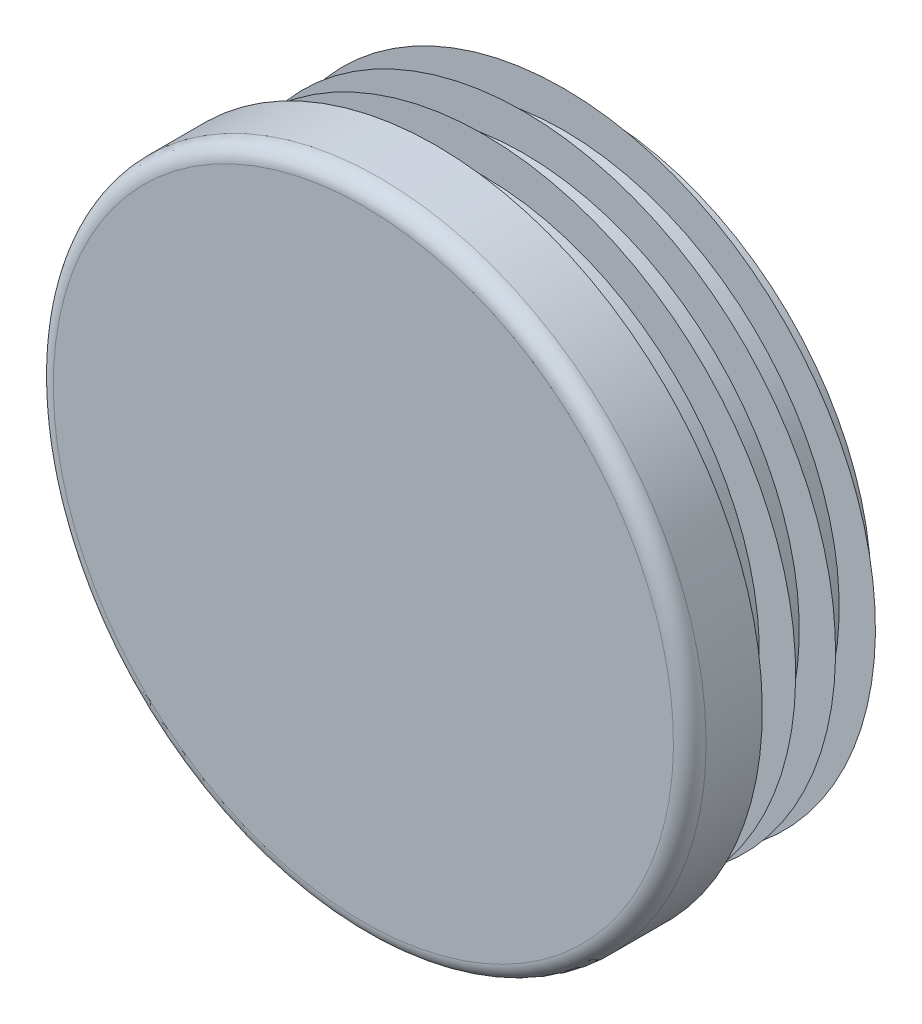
ISO-10303-21;
HEADER;
FILE_DESCRIPTION(('STEP AP214'),'2;1');
FILE_NAME('part.step','',(''),(''),'','','');
FILE_SCHEMA(('AUTOMOTIVE_DESIGN { 1 0 10303 214 1 1 1 1 }'));
ENDSEC;
DATA;
#1=APPLICATION_CONTEXT('core data for automotive mechanical design processes');
#2=APPLICATION_PROTOCOL_DEFINITION('international standard','automotive_design',2000,#1);
#3=PRODUCT_CONTEXT('',#1,'mechanical');
#4=PRODUCT('Part','Part','',(#3));
#5=PRODUCT_RELATED_PRODUCT_CATEGORY('part','',(#4));
#6=PRODUCT_DEFINITION_FORMATION('','',#4);
#7=PRODUCT_DEFINITION_CONTEXT('part definition',#1,'design');
#8=PRODUCT_DEFINITION('design','',#6,#7);
#9=PRODUCT_DEFINITION_SHAPE('','',#8);
#10=(LENGTH_UNIT() NAMED_UNIT(*) SI_UNIT(.MILLI.,.METRE.));
#11=(NAMED_UNIT(*) PLANE_ANGLE_UNIT() SI_UNIT($,.RADIAN.));
#12=(NAMED_UNIT(*) SI_UNIT($,.STERADIAN.) SOLID_ANGLE_UNIT());
#13=UNCERTAINTY_MEASURE_WITH_UNIT(LENGTH_MEASURE(1.E-05),#10,'distance_accuracy_value','');
#14=(GEOMETRIC_REPRESENTATION_CONTEXT(3) GLOBAL_UNCERTAINTY_ASSIGNED_CONTEXT((#13)) GLOBAL_UNIT_ASSIGNED_CONTEXT((#10,
#11,#12)) REPRESENTATION_CONTEXT('',''));
#15=CARTESIAN_POINT('',(0.,0.,0.));
#16=DIRECTION('',(0.,0.,1.));
#17=DIRECTION('',(1.,0.,0.));
#18=AXIS2_PLACEMENT_3D('',#15,#16,#17);
#19=CARTESIAN_POINT('',(0.,0.,5.));
#20=DIRECTION('',(0.,0.,-1.));
#21=DIRECTION('',(0.,1.,0.));
#22=AXIS2_PLACEMENT_3D('',#19,#20,#21);
#23=PLANE('',#22);
#24=CARTESIAN_POINT('',(0.,0.,5.));
#25=DIRECTION('',(0.,0.,-1.));
#26=DIRECTION('',(0.,1.,0.));
#27=AXIS2_PLACEMENT_3D('',#24,#25,#26);
#28=CIRCLE('',#27,21.375);
#29=CARTESIAN_POINT('',(0.,21.375,5.));
#30=VERTEX_POINT('',#29);
#31=EDGE_CURVE('E8',#30,#30,#28,.T.);
#32=ORIENTED_EDGE('',*,*,#31,.F.);
#33=EDGE_LOOP('',(#32));
#34=FACE_BOUND('',#33,.T.);
#35=ADVANCED_FACE('F12',(#34),#23,.F.);
#36=CARTESIAN_POINT('',(0.,0.,3.875));
#37=DIRECTION('',(0.,0.,-1.));
#38=DIRECTION('',(0.,1.,0.));
#39=AXIS2_PLACEMENT_3D('',#36,#37,#38);
#40=TOROIDAL_SURFACE('',#39,21.375,1.125);
#41=ORIENTED_EDGE('',*,*,#31,.T.);
#42=EDGE_LOOP('',(#41));
#43=FACE_BOUND('',#42,.T.);
#44=CARTESIAN_POINT('',(0.,0.,3.875));
#45=DIRECTION('',(0.,0.,-1.));
#46=DIRECTION('',(0.,1.,0.));
#47=AXIS2_PLACEMENT_3D('',#44,#45,#46);
#48=CIRCLE('',#47,22.5);
#49=CARTESIAN_POINT('',(0.,22.5,3.875));
#50=VERTEX_POINT('',#49);
#51=EDGE_CURVE('E18',#50,#50,#48,.T.);
#52=ORIENTED_EDGE('',*,*,#51,.F.);
#53=EDGE_LOOP('',(#52));
#54=FACE_BOUND('',#53,.T.);
#55=ADVANCED_FACE('F159',(#43,#54),#40,.T.);
#56=CARTESIAN_POINT('',(0.,0.,-11.));
#57=DIRECTION('',(0.,0.,-1.));
#58=DIRECTION('',(0.,1.,0.));
#59=AXIS2_PLACEMENT_3D('',#56,#57,#58);
#60=CYLINDRICAL_SURFACE('',#59,22.5);
#61=CARTESIAN_POINT('',(0.,0.,0.));
#62=DIRECTION('',(0.,0.,-1.));
#63=DIRECTION('',(0.,1.,0.));
#64=AXIS2_PLACEMENT_3D('',#61,#62,#63);
#65=CIRCLE('',#64,22.5);
#66=CARTESIAN_POINT('',(0.,22.5,0.));
#67=VERTEX_POINT('',#66);
#68=EDGE_CURVE('E22',#67,#67,#65,.T.);
#69=ORIENTED_EDGE('',*,*,#68,.F.);
#70=EDGE_LOOP('',(#69));
#71=FACE_BOUND('',#70,.T.);
#72=ORIENTED_EDGE('',*,*,#51,.T.);
#73=EDGE_LOOP('',(#72));
#74=FACE_BOUND('',#73,.T.);
#75=ADVANCED_FACE('F154',(#71,#74),#60,.T.);
#76=CARTESIAN_POINT('',(22.5,0.,0.));
#77=DIRECTION('',(0.,0.,1.));
#78=DIRECTION('',(0.,-1.,0.));
#79=AXIS2_PLACEMENT_3D('',#76,#77,#78);
#80=PLANE('',#79);
#81=CARTESIAN_POINT('',(0.,0.,0.));
#82=DIRECTION('',(0.,0.,-1.));
#83=DIRECTION('',(0.,1.,0.));
#84=AXIS2_PLACEMENT_3D('',#81,#82,#83);
#85=CIRCLE('',#84,19.);
#86=CARTESIAN_POINT('',(0.,19.,0.));
#87=VERTEX_POINT('',#86);
#88=EDGE_CURVE('E26',#87,#87,#85,.T.);
#89=ORIENTED_EDGE('',*,*,#88,.F.);
#90=EDGE_LOOP('',(#89));
#91=FACE_BOUND('',#90,.T.);
#92=ORIENTED_EDGE('',*,*,#68,.T.);
#93=EDGE_LOOP('',(#92));
#94=FACE_BOUND('',#93,.T.);
#95=ADVANCED_FACE('F148',(#91,#94),#80,.F.);
#96=CARTESIAN_POINT('',(0.,0.,-11.));
#97=DIRECTION('',(0.,0.,-1.));
#98=DIRECTION('',(0.,1.,0.));
#99=AXIS2_PLACEMENT_3D('',#96,#97,#98);
#100=CYLINDRICAL_SURFACE('',#99,19.);
#101=CARTESIAN_POINT('',(0.,0.,-0.55));
#102=DIRECTION('',(0.,0.,-1.));
#103=DIRECTION('',(0.,1.,0.));
#104=AXIS2_PLACEMENT_3D('',#101,#102,#103);
#105=CIRCLE('',#104,19.);
#106=CARTESIAN_POINT('',(0.,19.,-0.55));
#107=VERTEX_POINT('',#106);
#108=EDGE_CURVE('E31',#107,#107,#105,.T.);
#109=ORIENTED_EDGE('',*,*,#108,.F.);
#110=EDGE_LOOP('',(#109));
#111=FACE_BOUND('',#110,.T.);
#112=ORIENTED_EDGE('',*,*,#88,.T.);
#113=EDGE_LOOP('',(#112));
#114=FACE_BOUND('',#113,.T.);
#115=ADVANCED_FACE('F142',(#111,#114),#100,.T.);
#116=CARTESIAN_POINT('',(19.,0.,-0.55));
#117=DIRECTION('',(0.,0.,-1.));
#118=DIRECTION('',(0.,1.,0.));
#119=AXIS2_PLACEMENT_3D('',#116,#117,#118);
#120=PLANE('',#119);
#121=CARTESIAN_POINT('',(0.,0.,-0.55));
#122=DIRECTION('',(0.,0.,-1.));
#123=DIRECTION('',(0.,1.,0.));
#124=AXIS2_PLACEMENT_3D('',#121,#122,#123);
#125=CIRCLE('',#124,21.5);
#126=CARTESIAN_POINT('',(0.,21.5,-0.55));
#127=VERTEX_POINT('',#126);
#128=EDGE_CURVE('E34',#127,#127,#125,.T.);
#129=ORIENTED_EDGE('',*,*,#128,.F.);
#130=EDGE_LOOP('',(#129));
#131=FACE_BOUND('',#130,.T.);
#132=ORIENTED_EDGE('',*,*,#108,.T.);
#133=EDGE_LOOP('',(#132));
#134=FACE_BOUND('',#133,.T.);
#135=ADVANCED_FACE('F136',(#131,#134),#120,.F.);
#136=CARTESIAN_POINT('',(0.,0.,-0.55));
#137=DIRECTION('',(0.,0.,1.));
#138=DIRECTION('',(0.,-1.,0.));
#139=AXIS2_PLACEMENT_3D('',#136,#137,#138);
#140=CONICAL_SURFACE('',#139,21.5,0.959931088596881);
#141=CARTESIAN_POINT('',(0.,0.,-2.30051884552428));
#142=DIRECTION('',(0.,0.,-1.));
#143=DIRECTION('',(0.,1.,0.));
#144=AXIS2_PLACEMENT_3D('',#141,#142,#143);
#145=CIRCLE('',#144,19.);
#146=CARTESIAN_POINT('',(0.,19.,-2.30051884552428));
#147=VERTEX_POINT('',#146);
#148=EDGE_CURVE('E37',#147,#147,#145,.T.);
#149=ORIENTED_EDGE('',*,*,#148,.F.);
#150=EDGE_LOOP('',(#149));
#151=FACE_BOUND('',#150,.T.);
#152=ORIENTED_EDGE('',*,*,#128,.T.);
#153=EDGE_LOOP('',(#152));
#154=FACE_BOUND('',#153,.T.);
#155=ADVANCED_FACE('F130',(#151,#154),#140,.T.);
#156=CARTESIAN_POINT('',(0.,0.,-11.));
#157=DIRECTION('',(0.,0.,-1.));
#158=DIRECTION('',(0.,1.,0.));
#159=AXIS2_PLACEMENT_3D('',#156,#157,#158);
#160=CYLINDRICAL_SURFACE('',#159,19.);
#161=CARTESIAN_POINT('',(0.,0.,-3.3));
#162=DIRECTION('',(0.,0.,-1.));
#163=DIRECTION('',(0.,1.,0.));
#164=AXIS2_PLACEMENT_3D('',#161,#162,#163);
#165=CIRCLE('',#164,19.);
#166=CARTESIAN_POINT('',(0.,19.,-3.3));
#167=VERTEX_POINT('',#166);
#168=EDGE_CURVE('E40',#167,#167,#165,.T.);
#169=ORIENTED_EDGE('',*,*,#168,.F.);
#170=EDGE_LOOP('',(#169));
#171=FACE_BOUND('',#170,.T.);
#172=ORIENTED_EDGE('',*,*,#148,.T.);
#173=EDGE_LOOP('',(#172));
#174=FACE_BOUND('',#173,.T.);
#175=ADVANCED_FACE('F124',(#171,#174),#160,.T.);
#176=CARTESIAN_POINT('',(19.,0.,-3.3));
#177=DIRECTION('',(0.,0.,-1.));
#178=DIRECTION('',(0.,1.,0.));
#179=AXIS2_PLACEMENT_3D('',#176,#177,#178);
#180=PLANE('',#179);
#181=CARTESIAN_POINT('',(0.,0.,-3.3));
#182=DIRECTION('',(0.,0.,-1.));
#183=DIRECTION('',(0.,1.,0.));
#184=AXIS2_PLACEMENT_3D('',#181,#182,#183);
#185=CIRCLE('',#184,21.5);
#186=CARTESIAN_POINT('',(0.,21.5,-3.3));
#187=VERTEX_POINT('',#186);
#188=EDGE_CURVE('E43',#187,#187,#185,.T.);
#189=ORIENTED_EDGE('',*,*,#188,.F.);
#190=EDGE_LOOP('',(#189));
#191=FACE_BOUND('',#190,.T.);
#192=ORIENTED_EDGE('',*,*,#168,.T.);
#193=EDGE_LOOP('',(#192));
#194=FACE_BOUND('',#193,.T.);
#195=ADVANCED_FACE('F118',(#191,#194),#180,.F.);
#196=CARTESIAN_POINT('',(0.,0.,-3.3));
#197=DIRECTION('',(0.,0.,1.));
#198=DIRECTION('',(0.,-1.,0.));
#199=AXIS2_PLACEMENT_3D('',#196,#197,#198);
#200=CONICAL_SURFACE('',#199,21.5,0.959931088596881);
#201=CARTESIAN_POINT('',(0.,0.,-5.05051884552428));
#202=DIRECTION('',(0.,0.,-1.));
#203=DIRECTION('',(0.,1.,0.));
#204=AXIS2_PLACEMENT_3D('',#201,#202,#203);
#205=CIRCLE('',#204,19.);
#206=CARTESIAN_POINT('',(0.,19.,-5.05051884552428));
#207=VERTEX_POINT('',#206);
#208=EDGE_CURVE('E46',#207,#207,#205,.T.);
#209=ORIENTED_EDGE('',*,*,#208,.F.);
#210=EDGE_LOOP('',(#209));
#211=FACE_BOUND('',#210,.T.);
#212=ORIENTED_EDGE('',*,*,#188,.T.);
#213=EDGE_LOOP('',(#212));
#214=FACE_BOUND('',#213,.T.);
#215=ADVANCED_FACE('F112',(#211,#214),#200,.T.);
#216=CARTESIAN_POINT('',(0.,0.,-11.));
#217=DIRECTION('',(0.,0.,-1.));
#218=DIRECTION('',(0.,1.,0.));
#219=AXIS2_PLACEMENT_3D('',#216,#217,#218);
#220=CYLINDRICAL_SURFACE('',#219,19.);
#221=CARTESIAN_POINT('',(0.,0.,-6.05));
#222=DIRECTION('',(0.,0.,-1.));
#223=DIRECTION('',(0.,1.,0.));
#224=AXIS2_PLACEMENT_3D('',#221,#222,#223);
#225=CIRCLE('',#224,19.);
#226=CARTESIAN_POINT('',(0.,19.,-6.05));
#227=VERTEX_POINT('',#226);
#228=EDGE_CURVE('E49',#227,#227,#225,.T.);
#229=ORIENTED_EDGE('',*,*,#228,.F.);
#230=EDGE_LOOP('',(#229));
#231=FACE_BOUND('',#230,.T.);
#232=ORIENTED_EDGE('',*,*,#208,.T.);
#233=EDGE_LOOP('',(#232));
#234=FACE_BOUND('',#233,.T.);
#235=ADVANCED_FACE('F106',(#231,#234),#220,.T.);
#236=CARTESIAN_POINT('',(19.,0.,-6.05));
#237=DIRECTION('',(0.,0.,-1.));
#238=DIRECTION('',(0.,1.,0.));
#239=AXIS2_PLACEMENT_3D('',#236,#237,#238);
#240=PLANE('',#239);
#241=CARTESIAN_POINT('',(0.,0.,-6.05));
#242=DIRECTION('',(0.,0.,-1.));
#243=DIRECTION('',(0.,1.,0.));
#244=AXIS2_PLACEMENT_3D('',#241,#242,#243);
#245=CIRCLE('',#244,21.5);
#246=CARTESIAN_POINT('',(0.,21.5,-6.05));
#247=VERTEX_POINT('',#246);
#248=EDGE_CURVE('E52',#247,#247,#245,.T.);
#249=ORIENTED_EDGE('',*,*,#248,.F.);
#250=EDGE_LOOP('',(#249));
#251=FACE_BOUND('',#250,.T.);
#252=ORIENTED_EDGE('',*,*,#228,.T.);
#253=EDGE_LOOP('',(#252));
#254=FACE_BOUND('',#253,.T.);
#255=ADVANCED_FACE('F100',(#251,#254),#240,.F.);
#256=CARTESIAN_POINT('',(0.,0.,-6.05));
#257=DIRECTION('',(0.,0.,1.));
#258=DIRECTION('',(0.,-1.,0.));
#259=AXIS2_PLACEMENT_3D('',#256,#257,#258);
#260=CONICAL_SURFACE('',#259,21.5,0.959931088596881);
#261=CARTESIAN_POINT('',(0.,0.,-7.80051884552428));
#262=DIRECTION('',(0.,0.,-1.));
#263=DIRECTION('',(0.,1.,0.));
#264=AXIS2_PLACEMENT_3D('',#261,#262,#263);
#265=CIRCLE('',#264,19.);
#266=CARTESIAN_POINT('',(0.,19.,-7.80051884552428));
#267=VERTEX_POINT('',#266);
#268=EDGE_CURVE('E55',#267,#267,#265,.T.);
#269=ORIENTED_EDGE('',*,*,#268,.F.);
#270=EDGE_LOOP('',(#269));
#271=FACE_BOUND('',#270,.T.);
#272=ORIENTED_EDGE('',*,*,#248,.T.);
#273=EDGE_LOOP('',(#272));
#274=FACE_BOUND('',#273,.T.);
#275=ADVANCED_FACE('F94',(#271,#274),#260,.T.);
#276=CARTESIAN_POINT('',(0.,0.,-11.));
#277=DIRECTION('',(0.,0.,-1.));
#278=DIRECTION('',(0.,1.,0.));
#279=AXIS2_PLACEMENT_3D('',#276,#277,#278);
#280=CYLINDRICAL_SURFACE('',#279,19.);
#281=CARTESIAN_POINT('',(0.,0.,-8.8));
#282=DIRECTION('',(0.,0.,-1.));
#283=DIRECTION('',(0.,1.,0.));
#284=AXIS2_PLACEMENT_3D('',#281,#282,#283);
#285=CIRCLE('',#284,19.);
#286=CARTESIAN_POINT('',(0.,19.,-8.8));
#287=VERTEX_POINT('',#286);
#288=EDGE_CURVE('E58',#287,#287,#285,.T.);
#289=ORIENTED_EDGE('',*,*,#288,.F.);
#290=EDGE_LOOP('',(#289));
#291=FACE_BOUND('',#290,.T.);
#292=ORIENTED_EDGE('',*,*,#268,.T.);
#293=EDGE_LOOP('',(#292));
#294=FACE_BOUND('',#293,.T.);
#295=ADVANCED_FACE('F88',(#291,#294),#280,.T.);
#296=CARTESIAN_POINT('',(19.,0.,-8.8));
#297=DIRECTION('',(0.,0.,-1.));
#298=DIRECTION('',(0.,1.,0.));
#299=AXIS2_PLACEMENT_3D('',#296,#297,#298);
#300=PLANE('',#299);
#301=CARTESIAN_POINT('',(0.,0.,-8.8));
#302=DIRECTION('',(0.,0.,-1.));
#303=DIRECTION('',(0.,1.,0.));
#304=AXIS2_PLACEMENT_3D('',#301,#302,#303);
#305=CIRCLE('',#304,21.5);
#306=CARTESIAN_POINT('',(0.,21.5,-8.8));
#307=VERTEX_POINT('',#306);
#308=EDGE_CURVE('E61',#307,#307,#305,.T.);
#309=ORIENTED_EDGE('',*,*,#308,.F.);
#310=EDGE_LOOP('',(#309));
#311=FACE_BOUND('',#310,.T.);
#312=ORIENTED_EDGE('',*,*,#288,.T.);
#313=EDGE_LOOP('',(#312));
#314=FACE_BOUND('',#313,.T.);
#315=ADVANCED_FACE('F82',(#311,#314),#300,.F.);
#316=CARTESIAN_POINT('',(0.,0.,-8.8));
#317=DIRECTION('',(0.,0.,1.));
#318=DIRECTION('',(0.,-1.,0.));
#319=AXIS2_PLACEMENT_3D('',#316,#317,#318);
#320=CONICAL_SURFACE('',#319,21.5,0.959931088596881);
#321=CARTESIAN_POINT('',(0.,0.,-10.5505188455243));
#322=DIRECTION('',(0.,0.,-1.));
#323=DIRECTION('',(0.,1.,0.));
#324=AXIS2_PLACEMENT_3D('',#321,#322,#323);
#325=CIRCLE('',#324,19.);
#326=CARTESIAN_POINT('',(0.,19.,-10.5505188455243));
#327=VERTEX_POINT('',#326);
#328=EDGE_CURVE('E64',#327,#327,#325,.T.);
#329=ORIENTED_EDGE('',*,*,#328,.F.);
#330=EDGE_LOOP('',(#329));
#331=FACE_BOUND('',#330,.T.);
#332=ORIENTED_EDGE('',*,*,#308,.T.);
#333=EDGE_LOOP('',(#332));
#334=FACE_BOUND('',#333,.T.);
#335=ADVANCED_FACE('F76',(#331,#334),#320,.T.);
#336=CARTESIAN_POINT('',(0.,0.,-11.));
#337=DIRECTION('',(0.,0.,-1.));
#338=DIRECTION('',(0.,1.,0.));
#339=AXIS2_PLACEMENT_3D('',#336,#337,#338);
#340=CYLINDRICAL_SURFACE('',#339,19.);
#341=CARTESIAN_POINT('',(0.,0.,-11.));
#342=DIRECTION('',(0.,0.,-1.));
#343=DIRECTION('',(0.,1.,0.));
#344=AXIS2_PLACEMENT_3D('',#341,#342,#343);
#345=CIRCLE('',#344,19.);
#346=CARTESIAN_POINT('',(0.,19.,-11.));
#347=VERTEX_POINT('',#346);
#348=EDGE_CURVE('E67',#347,#347,#345,.T.);
#349=ORIENTED_EDGE('',*,*,#348,.F.);
#350=EDGE_LOOP('',(#349));
#351=FACE_BOUND('',#350,.T.);
#352=ORIENTED_EDGE('',*,*,#328,.T.);
#353=EDGE_LOOP('',(#352));
#354=FACE_BOUND('',#353,.T.);
#355=ADVANCED_FACE('F73',(#351,#354),#340,.T.);
#356=CARTESIAN_POINT('',(19.,0.,-11.));
#357=DIRECTION('',(0.,0.,1.));
#358=DIRECTION('',(0.,-1.,0.));
#359=AXIS2_PLACEMENT_3D('',#356,#357,#358);
#360=PLANE('',#359);
#361=ORIENTED_EDGE('',*,*,#348,.T.);
#362=EDGE_LOOP('',(#361));
#363=FACE_BOUND('',#362,.T.);
#364=ADVANCED_FACE('F71',(#363),#360,.F.);
#365=CLOSED_SHELL('',(#35,#55,#75,#95,#115,#135,#155,#175,#195,#215,#235,#255,#275,#295,#315,
#335,#355,#364));
#366=MANIFOLD_SOLID_BREP('B1',#365);
#367=ADVANCED_BREP_SHAPE_REPRESENTATION('',(#18,#366),#14);
#368=SHAPE_DEFINITION_REPRESENTATION(#9,#367);
ENDSEC;
END-ISO-10303-21;
